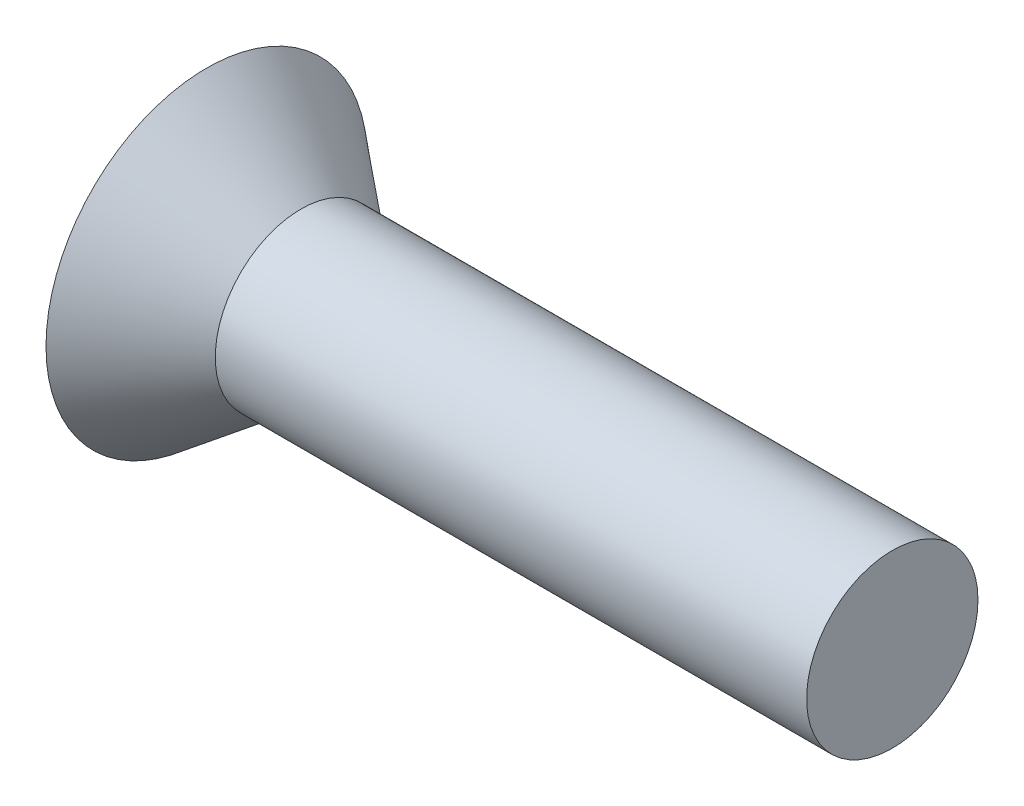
ISO-10303-21;
HEADER;
FILE_DESCRIPTION(('STEP AP214'),'2;1');
FILE_NAME('part.step','',(''),(''),'','','');
FILE_SCHEMA(('AUTOMOTIVE_DESIGN { 1 0 10303 214 1 1 1 1 }'));
ENDSEC;
DATA;
#1=APPLICATION_CONTEXT('core data for automotive mechanical design processes');
#2=APPLICATION_PROTOCOL_DEFINITION('international standard','automotive_design',2000,#1);
#3=PRODUCT_CONTEXT('',#1,'mechanical');
#4=PRODUCT('Part','Part','',(#3));
#5=PRODUCT_RELATED_PRODUCT_CATEGORY('part','',(#4));
#6=PRODUCT_DEFINITION_FORMATION('','',#4);
#7=PRODUCT_DEFINITION_CONTEXT('part definition',#1,'design');
#8=PRODUCT_DEFINITION('design','',#6,#7);
#9=PRODUCT_DEFINITION_SHAPE('','',#8);
#10=(LENGTH_UNIT() NAMED_UNIT(*) SI_UNIT(.MILLI.,.METRE.));
#11=(NAMED_UNIT(*) PLANE_ANGLE_UNIT() SI_UNIT($,.RADIAN.));
#12=(NAMED_UNIT(*) SI_UNIT($,.STERADIAN.) SOLID_ANGLE_UNIT());
#13=UNCERTAINTY_MEASURE_WITH_UNIT(LENGTH_MEASURE(1.E-05),#10,'distance_accuracy_value','');
#14=(GEOMETRIC_REPRESENTATION_CONTEXT(3) GLOBAL_UNCERTAINTY_ASSIGNED_CONTEXT((#13)) GLOBAL_UNIT_ASSIGNED_CONTEXT((#10,
#11,#12)) REPRESENTATION_CONTEXT('',''));
#15=CARTESIAN_POINT('',(0.,0.,0.));
#16=DIRECTION('',(0.,0.,1.));
#17=DIRECTION('',(1.,0.,0.));
#18=AXIS2_PLACEMENT_3D('',#15,#16,#17);
#19=CARTESIAN_POINT('',(0.,0.,0.));
#20=DIRECTION('',(-1.,0.,0.));
#21=DIRECTION('',(0.,0.,1.));
#22=AXIS2_PLACEMENT_3D('',#19,#20,#21);
#23=PLANE('',#22);
#24=CARTESIAN_POINT('',(0.,0.,0.));
#25=DIRECTION('',(1.,0.,0.));
#26=DIRECTION('',(0.,0.,-1.));
#27=AXIS2_PLACEMENT_3D('',#24,#25,#26);
#28=CIRCLE('',#27,3.75);
#29=CARTESIAN_POINT('',(0.,0.,-3.75));
#30=VERTEX_POINT('',#29);
#31=EDGE_CURVE('E10',#30,#30,#28,.T.);
#32=ORIENTED_EDGE('',*,*,#31,.F.);
#33=EDGE_LOOP('',(#32));
#34=FACE_BOUND('',#33,.T.);
#35=ADVANCED_FACE('F33',(#34),#23,.T.);
#36=CARTESIAN_POINT('',(2.2,0.,0.));
#37=DIRECTION('',(-1.,0.,0.));
#38=DIRECTION('',(0.,0.,1.));
#39=AXIS2_PLACEMENT_3D('',#36,#37,#38);
#40=CONICAL_SURFACE('',#39,2.,0.671963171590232);
#41=ORIENTED_EDGE('',*,*,#31,.T.);
#42=EDGE_LOOP('',(#41));
#43=FACE_BOUND('',#42,.T.);
#44=CARTESIAN_POINT('',(2.2,0.,0.));
#45=DIRECTION('',(1.,0.,0.));
#46=DIRECTION('',(0.,0.,-1.));
#47=AXIS2_PLACEMENT_3D('',#44,#45,#46);
#48=CIRCLE('',#47,2.);
#49=CARTESIAN_POINT('',(2.2,0.,-2.));
#50=VERTEX_POINT('',#49);
#51=EDGE_CURVE('E39',#50,#50,#48,.T.);
#52=ORIENTED_EDGE('',*,*,#51,.F.);
#53=EDGE_LOOP('',(#52));
#54=FACE_BOUND('',#53,.T.);
#55=ADVANCED_FACE('F54',(#43,#54),#40,.T.);
#56=CARTESIAN_POINT('',(0.,0.,0.));
#57=DIRECTION('',(1.,0.,0.));
#58=DIRECTION('',(0.,0.,-1.));
#59=AXIS2_PLACEMENT_3D('',#56,#57,#58);
#60=CYLINDRICAL_SURFACE('',#59,2.);
#61=ORIENTED_EDGE('',*,*,#51,.T.);
#62=EDGE_LOOP('',(#61));
#63=FACE_BOUND('',#62,.T.);
#64=CARTESIAN_POINT('',(16.,0.,0.));
#65=DIRECTION('',(1.,0.,0.));
#66=DIRECTION('',(0.,0.,-1.));
#67=AXIS2_PLACEMENT_3D('',#64,#65,#66);
#68=CIRCLE('',#67,2.);
#69=CARTESIAN_POINT('',(16.,0.,-2.));
#70=VERTEX_POINT('',#69);
#71=EDGE_CURVE('E43',#70,#70,#68,.T.);
#72=ORIENTED_EDGE('',*,*,#71,.F.);
#73=EDGE_LOOP('',(#72));
#74=FACE_BOUND('',#73,.T.);
#75=ADVANCED_FACE('F52',(#63,#74),#60,.T.);
#76=CARTESIAN_POINT('',(16.,2.,0.));
#77=DIRECTION('',(1.,0.,0.));
#78=DIRECTION('',(0.,0.,-1.));
#79=AXIS2_PLACEMENT_3D('',#76,#77,#78);
#80=PLANE('',#79);
#81=ORIENTED_EDGE('',*,*,#71,.T.);
#82=EDGE_LOOP('',(#81));
#83=FACE_BOUND('',#82,.T.);
#84=ADVANCED_FACE('F50',(#83),#80,.T.);
#85=CLOSED_SHELL('',(#35,#55,#75,#84));
#86=MANIFOLD_SOLID_BREP('B2',#85);
#87=ADVANCED_BREP_SHAPE_REPRESENTATION('',(#18,#86),#14);
#88=SHAPE_DEFINITION_REPRESENTATION(#9,#87);
ENDSEC;
END-ISO-10303-21;
